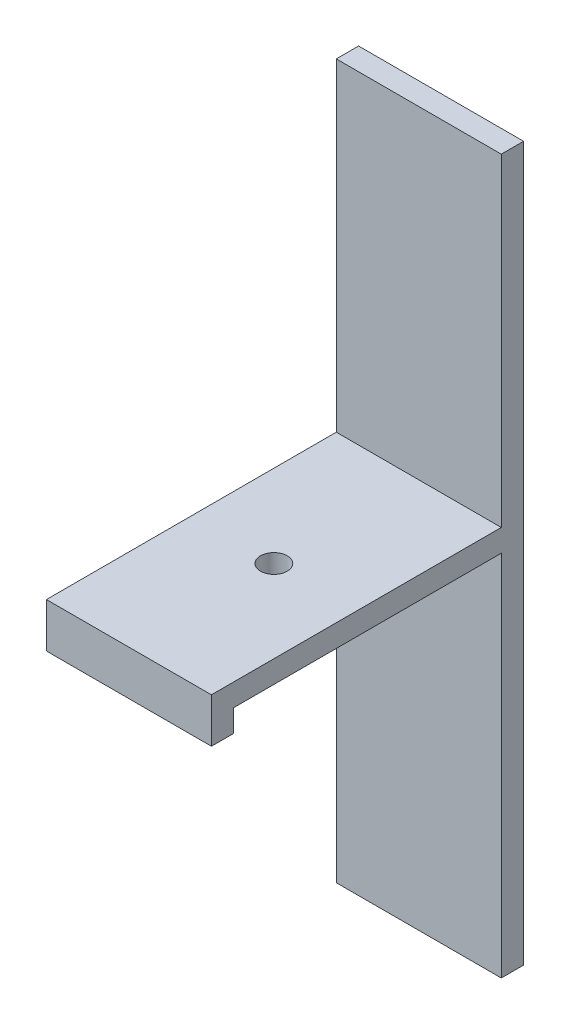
ISO-10303-21;
HEADER;
FILE_DESCRIPTION(('STEP AP214'),'2;1');
FILE_NAME('part.step','',(''),(''),'','','');
FILE_SCHEMA(('AUTOMOTIVE_DESIGN { 1 0 10303 214 1 1 1 1 }'));
ENDSEC;
DATA;
#1=APPLICATION_CONTEXT('core data for automotive mechanical design processes');
#2=APPLICATION_PROTOCOL_DEFINITION('international standard','automotive_design',2000,#1);
#3=PRODUCT_CONTEXT('',#1,'mechanical');
#4=PRODUCT('Part','Part','',(#3));
#5=PRODUCT_RELATED_PRODUCT_CATEGORY('part','',(#4));
#6=PRODUCT_DEFINITION_FORMATION('','',#4);
#7=PRODUCT_DEFINITION_CONTEXT('part definition',#1,'design');
#8=PRODUCT_DEFINITION('design','',#6,#7);
#9=PRODUCT_DEFINITION_SHAPE('','',#8);
#10=(LENGTH_UNIT() NAMED_UNIT(*) SI_UNIT(.MILLI.,.METRE.));
#11=(NAMED_UNIT(*) PLANE_ANGLE_UNIT() SI_UNIT($,.RADIAN.));
#12=(NAMED_UNIT(*) SI_UNIT($,.STERADIAN.) SOLID_ANGLE_UNIT());
#13=UNCERTAINTY_MEASURE_WITH_UNIT(LENGTH_MEASURE(1.E-05),#10,'distance_accuracy_value','');
#14=(GEOMETRIC_REPRESENTATION_CONTEXT(3) GLOBAL_UNCERTAINTY_ASSIGNED_CONTEXT((#13)) GLOBAL_UNIT_ASSIGNED_CONTEXT((#10,
#11,#12)) REPRESENTATION_CONTEXT('',''));
#15=CARTESIAN_POINT('',(0.,0.,0.));
#16=DIRECTION('',(0.,0.,1.));
#17=DIRECTION('',(1.,0.,0.));
#18=AXIS2_PLACEMENT_3D('',#15,#16,#17);
#19=CARTESIAN_POINT('',(-37.,-2.5,70.));
#20=DIRECTION('',(0.,1.,0.));
#21=DIRECTION('',(0.,0.,1.));
#22=AXIS2_PLACEMENT_3D('',#19,#20,#21);
#23=PLANE('',#22);
#24=CARTESIAN_POINT('',(-18.5,-2.5,37.5));
#25=DIRECTION('',(0.,1.,0.));
#26=DIRECTION('',(0.,0.,1.));
#27=AXIS2_PLACEMENT_3D('',#24,#25,#26);
#28=CIRCLE('',#27,3.);
#29=CARTESIAN_POINT('',(-18.5,-2.5,40.5));
#30=VERTEX_POINT('',#29);
#31=EDGE_CURVE('E138',#30,#30,#28,.T.);
#32=ORIENTED_EDGE('',*,*,#31,.T.);
#33=EDGE_LOOP('',(#32));
#34=FACE_BOUND('',#33,.T.);
#35=DIRECTION('',(1.,0.,0.));
#36=VECTOR('',#35,1.);
#37=CARTESIAN_POINT('',(-37.,-2.5,65.));
#38=LINE('',#37,#36);
#39=CARTESIAN_POINT('',(-37.,-2.5,65.));
#40=VERTEX_POINT('',#39);
#41=CARTESIAN_POINT('',(0.,-2.5,65.));
#42=VERTEX_POINT('',#41);
#43=EDGE_CURVE('E131',#40,#42,#38,.T.);
#44=ORIENTED_EDGE('',*,*,#43,.F.);
#45=DIRECTION('',(0.,0.,-1.));
#46=VECTOR('',#45,1.);
#47=CARTESIAN_POINT('',(-37.,-2.5,70.));
#48=LINE('',#47,#46);
#49=CARTESIAN_POINT('',(-37.,-2.5,5.));
#50=VERTEX_POINT('',#49);
#51=EDGE_CURVE('E48',#40,#50,#48,.T.);
#52=ORIENTED_EDGE('',*,*,#51,.T.);
#53=DIRECTION('',(1.,0.,0.));
#54=VECTOR('',#53,1.);
#55=CARTESIAN_POINT('',(-37.,-2.5,5.));
#56=LINE('',#55,#54);
#57=CARTESIAN_POINT('',(0.,-2.5,5.));
#58=VERTEX_POINT('',#57);
#59=EDGE_CURVE('E145',#50,#58,#56,.T.);
#60=ORIENTED_EDGE('',*,*,#59,.T.);
#61=DIRECTION('',(0.,0.,-1.));
#62=VECTOR('',#61,1.);
#63=CARTESIAN_POINT('',(0.,-2.5,70.));
#64=LINE('',#63,#62);
#65=EDGE_CURVE('E161',#42,#58,#64,.T.);
#66=ORIENTED_EDGE('',*,*,#65,.F.);
#67=EDGE_LOOP('',(#44,#52,#60,#66));
#68=FACE_BOUND('',#67,.T.);
#69=ADVANCED_FACE('F33',(#34,#68),#23,.F.);
#70=CARTESIAN_POINT('',(0.,0.,5.));
#71=DIRECTION('',(0.,0.,1.));
#72=DIRECTION('',(1.,0.,0.));
#73=AXIS2_PLACEMENT_3D('',#70,#71,#72);
#74=PLANE('',#73);
#75=DIRECTION('',(0.,-1.,0.));
#76=VECTOR('',#75,1.);
#77=CARTESIAN_POINT('',(-37.,75.,5.));
#78=LINE('',#77,#76);
#79=CARTESIAN_POINT('',(-37.,75.,5.));
#80=VERTEX_POINT('',#79);
#81=CARTESIAN_POINT('',(-37.,2.5,5.));
#82=VERTEX_POINT('',#81);
#83=EDGE_CURVE('E56',#80,#82,#78,.T.);
#84=ORIENTED_EDGE('',*,*,#83,.T.);
#85=DIRECTION('',(1.,0.,0.));
#86=VECTOR('',#85,1.);
#87=CARTESIAN_POINT('',(-37.,2.5,5.));
#88=LINE('',#87,#86);
#89=CARTESIAN_POINT('',(0.,2.5,5.));
#90=VERTEX_POINT('',#89);
#91=EDGE_CURVE('E149',#82,#90,#88,.T.);
#92=ORIENTED_EDGE('',*,*,#91,.T.);
#93=DIRECTION('',(0.,1.,0.));
#94=VECTOR('',#93,1.);
#95=CARTESIAN_POINT('',(0.,75.,5.));
#96=LINE('',#95,#94);
#97=CARTESIAN_POINT('',(0.,75.,5.));
#98=VERTEX_POINT('',#97);
#99=EDGE_CURVE('E169',#90,#98,#96,.T.);
#100=ORIENTED_EDGE('',*,*,#99,.T.);
#101=DIRECTION('',(-1.,0.,0.));
#102=VECTOR('',#101,1.);
#103=CARTESIAN_POINT('',(-37.,75.,5.));
#104=LINE('',#103,#102);
#105=EDGE_CURVE('E168',#98,#80,#104,.T.);
#106=ORIENTED_EDGE('',*,*,#105,.T.);
#107=EDGE_LOOP('',(#84,#92,#100,#106));
#108=FACE_BOUND('',#107,.T.);
#109=ADVANCED_FACE('F218',(#108),#74,.T.);
#110=CARTESIAN_POINT('',(0.,75.,5.));
#111=DIRECTION('',(-1.,0.,0.));
#112=DIRECTION('',(0.,-1.,0.));
#113=AXIS2_PLACEMENT_3D('',#110,#111,#112);
#114=PLANE('',#113);
#115=DIRECTION('',(0.,1.,0.));
#116=VECTOR('',#115,1.);
#117=CARTESIAN_POINT('',(0.,75.,0.));
#118=LINE('',#117,#116);
#119=CARTESIAN_POINT('',(0.,-85.,0.));
#120=VERTEX_POINT('',#119);
#121=CARTESIAN_POINT('',(0.,75.,0.));
#122=VERTEX_POINT('',#121);
#123=EDGE_CURVE('E164',#120,#122,#118,.T.);
#124=ORIENTED_EDGE('',*,*,#123,.T.);
#125=DIRECTION('',(0.,0.,-1.));
#126=VECTOR('',#125,1.);
#127=CARTESIAN_POINT('',(0.,75.,5.));
#128=LINE('',#127,#126);
#129=EDGE_CURVE('E11',#98,#122,#128,.T.);
#130=ORIENTED_EDGE('',*,*,#129,.F.);
#131=ORIENTED_EDGE('',*,*,#99,.F.);
#132=DIRECTION('',(0.,0.,-1.));
#133=VECTOR('',#132,1.);
#134=CARTESIAN_POINT('',(0.,2.5,70.));
#135=LINE('',#134,#133);
#136=CARTESIAN_POINT('',(0.,2.5,70.));
#137=VERTEX_POINT('',#136);
#138=EDGE_CURVE('E158',#137,#90,#135,.T.);
#139=ORIENTED_EDGE('',*,*,#138,.F.);
#140=DIRECTION('',(0.,-1.,0.));
#141=VECTOR('',#140,1.);
#142=CARTESIAN_POINT('',(0.,2.5,70.));
#143=LINE('',#142,#141);
#144=CARTESIAN_POINT('',(0.,-7.5,70.));
#145=VERTEX_POINT('',#144);
#146=EDGE_CURVE('E148',#137,#145,#143,.T.);
#147=ORIENTED_EDGE('',*,*,#146,.T.);
#148=DIRECTION('',(0.,0.,1.));
#149=VECTOR('',#148,1.);
#150=CARTESIAN_POINT('',(0.,-7.5,70.));
#151=LINE('',#150,#149);
#152=CARTESIAN_POINT('',(0.,-7.5,65.));
#153=VERTEX_POINT('',#152);
#154=EDGE_CURVE('E121',#153,#145,#151,.T.);
#155=ORIENTED_EDGE('',*,*,#154,.F.);
#156=DIRECTION('',(0.,1.,0.));
#157=VECTOR('',#156,1.);
#158=CARTESIAN_POINT('',(0.,-7.5,65.));
#159=LINE('',#158,#157);
#160=EDGE_CURVE('E117',#153,#42,#159,.T.);
#161=ORIENTED_EDGE('',*,*,#160,.T.);
#162=ORIENTED_EDGE('',*,*,#65,.T.);
#163=CARTESIAN_POINT('',(0.,-85.,5.));
#164=VERTEX_POINT('',#163);
#165=EDGE_CURVE('E165',#164,#58,#96,.T.);
#166=ORIENTED_EDGE('',*,*,#165,.F.);
#167=DIRECTION('',(0.,0.,-1.));
#168=VECTOR('',#167,1.);
#169=CARTESIAN_POINT('',(0.,-85.,5.));
#170=LINE('',#169,#168);
#171=EDGE_CURVE('E175',#164,#120,#170,.T.);
#172=ORIENTED_EDGE('',*,*,#171,.T.);
#173=EDGE_LOOP('',(#124,#130,#131,#139,#147,#155,#161,#162,#166,#172));
#174=FACE_BOUND('',#173,.T.);
#175=ADVANCED_FACE('F35',(#174),#114,.F.);
#176=CARTESIAN_POINT('',(-37.,75.,5.));
#177=DIRECTION('',(0.,-1.,0.));
#178=DIRECTION('',(0.,0.,-1.));
#179=AXIS2_PLACEMENT_3D('',#176,#177,#178);
#180=PLANE('',#179);
#181=DIRECTION('',(-1.,0.,0.));
#182=VECTOR('',#181,1.);
#183=CARTESIAN_POINT('',(-37.,75.,0.));
#184=LINE('',#183,#182);
#185=CARTESIAN_POINT('',(-37.,75.,0.));
#186=VERTEX_POINT('',#185);
#187=EDGE_CURVE('E178',#122,#186,#184,.T.);
#188=ORIENTED_EDGE('',*,*,#187,.T.);
#189=DIRECTION('',(0.,0.,-1.));
#190=VECTOR('',#189,1.);
#191=CARTESIAN_POINT('',(-37.,75.,5.));
#192=LINE('',#191,#190);
#193=EDGE_CURVE('E41',#80,#186,#192,.T.);
#194=ORIENTED_EDGE('',*,*,#193,.F.);
#195=ORIENTED_EDGE('',*,*,#105,.F.);
#196=ORIENTED_EDGE('',*,*,#129,.T.);
#197=EDGE_LOOP('',(#188,#194,#195,#196));
#198=FACE_BOUND('',#197,.T.);
#199=ADVANCED_FACE('F219',(#198),#180,.F.);
#200=CARTESIAN_POINT('',(-37.,75.,5.));
#201=DIRECTION('',(1.,0.,0.));
#202=DIRECTION('',(0.,1.,0.));
#203=AXIS2_PLACEMENT_3D('',#200,#201,#202);
#204=PLANE('',#203);
#205=DIRECTION('',(0.,-1.,0.));
#206=VECTOR('',#205,1.);
#207=CARTESIAN_POINT('',(-37.,75.,0.));
#208=LINE('',#207,#206);
#209=CARTESIAN_POINT('',(-37.,-85.,0.));
#210=VERTEX_POINT('',#209);
#211=EDGE_CURVE('E180',#186,#210,#208,.T.);
#212=ORIENTED_EDGE('',*,*,#211,.T.);
#213=DIRECTION('',(0.,0.,-1.));
#214=VECTOR('',#213,1.);
#215=CARTESIAN_POINT('',(-37.,-85.,5.));
#216=LINE('',#215,#214);
#217=CARTESIAN_POINT('',(-37.,-85.,5.));
#218=VERTEX_POINT('',#217);
#219=EDGE_CURVE('E186',#218,#210,#216,.T.);
#220=ORIENTED_EDGE('',*,*,#219,.F.);
#221=EDGE_CURVE('E171',#50,#218,#78,.T.);
#222=ORIENTED_EDGE('',*,*,#221,.F.);
#223=ORIENTED_EDGE('',*,*,#51,.F.);
#224=DIRECTION('',(0.,1.,0.));
#225=VECTOR('',#224,1.);
#226=CARTESIAN_POINT('',(-37.,-7.5,65.));
#227=LINE('',#226,#225);
#228=CARTESIAN_POINT('',(-37.,-7.5,65.));
#229=VERTEX_POINT('',#228);
#230=EDGE_CURVE('E115',#229,#40,#227,.T.);
#231=ORIENTED_EDGE('',*,*,#230,.F.);
#232=DIRECTION('',(0.,0.,-1.));
#233=VECTOR('',#232,1.);
#234=CARTESIAN_POINT('',(-37.,-7.5,70.));
#235=LINE('',#234,#233);
#236=CARTESIAN_POINT('',(-37.,-7.5,70.));
#237=VERTEX_POINT('',#236);
#238=EDGE_CURVE('E122',#237,#229,#235,.T.);
#239=ORIENTED_EDGE('',*,*,#238,.F.);
#240=DIRECTION('',(0.,-1.,0.));
#241=VECTOR('',#240,1.);
#242=CARTESIAN_POINT('',(-37.,2.5,70.));
#243=LINE('',#242,#241);
#244=CARTESIAN_POINT('',(-37.,2.5,70.));
#245=VERTEX_POINT('',#244);
#246=EDGE_CURVE('E146',#245,#237,#243,.T.);
#247=ORIENTED_EDGE('',*,*,#246,.F.);
#248=DIRECTION('',(0.,0.,-1.));
#249=VECTOR('',#248,1.);
#250=CARTESIAN_POINT('',(-37.,2.5,70.));
#251=LINE('',#250,#249);
#252=EDGE_CURVE('E154',#245,#82,#251,.T.);
#253=ORIENTED_EDGE('',*,*,#252,.T.);
#254=ORIENTED_EDGE('',*,*,#83,.F.);
#255=ORIENTED_EDGE('',*,*,#193,.T.);
#256=EDGE_LOOP('',(#212,#220,#222,#223,#231,#239,#247,#253,#254,#255));
#257=FACE_BOUND('',#256,.T.);
#258=ADVANCED_FACE('F133',(#257),#204,.F.);
#259=CARTESIAN_POINT('',(-37.,-85.,5.));
#260=DIRECTION('',(0.,1.,0.));
#261=DIRECTION('',(0.,0.,1.));
#262=AXIS2_PLACEMENT_3D('',#259,#260,#261);
#263=PLANE('',#262);
#264=DIRECTION('',(1.,0.,0.));
#265=VECTOR('',#264,1.);
#266=CARTESIAN_POINT('',(-37.,-85.,0.));
#267=LINE('',#266,#265);
#268=EDGE_CURVE('E182',#210,#120,#267,.T.);
#269=ORIENTED_EDGE('',*,*,#268,.T.);
#270=ORIENTED_EDGE('',*,*,#171,.F.);
#271=DIRECTION('',(1.,0.,0.));
#272=VECTOR('',#271,1.);
#273=CARTESIAN_POINT('',(-37.,-85.,5.));
#274=LINE('',#273,#272);
#275=EDGE_CURVE('E173',#218,#164,#274,.T.);
#276=ORIENTED_EDGE('',*,*,#275,.F.);
#277=ORIENTED_EDGE('',*,*,#219,.T.);
#278=EDGE_LOOP('',(#269,#270,#276,#277));
#279=FACE_BOUND('',#278,.T.);
#280=ADVANCED_FACE('F200',(#279),#263,.F.);
#281=ORIENTED_EDGE('',*,*,#59,.F.);
#282=ORIENTED_EDGE('',*,*,#221,.T.);
#283=ORIENTED_EDGE('',*,*,#275,.T.);
#284=ORIENTED_EDGE('',*,*,#165,.T.);
#285=EDGE_LOOP('',(#281,#282,#283,#284));
#286=FACE_BOUND('',#285,.T.);
#287=ADVANCED_FACE('F207',(#286),#74,.T.);
#288=CARTESIAN_POINT('',(0.,0.,0.));
#289=DIRECTION('',(0.,0.,1.));
#290=DIRECTION('',(1.,0.,0.));
#291=AXIS2_PLACEMENT_3D('',#288,#289,#290);
#292=PLANE('',#291);
#293=ORIENTED_EDGE('',*,*,#123,.F.);
#294=ORIENTED_EDGE('',*,*,#268,.F.);
#295=ORIENTED_EDGE('',*,*,#211,.F.);
#296=ORIENTED_EDGE('',*,*,#187,.F.);
#297=EDGE_LOOP('',(#293,#294,#295,#296));
#298=FACE_BOUND('',#297,.T.);
#299=ADVANCED_FACE('F197',(#298),#292,.F.);
#300=CARTESIAN_POINT('',(-37.,2.5,70.));
#301=DIRECTION('',(0.,1.,0.));
#302=DIRECTION('',(0.,0.,1.));
#303=AXIS2_PLACEMENT_3D('',#300,#301,#302);
#304=PLANE('',#303);
#305=CARTESIAN_POINT('',(-18.5,2.5,37.5));
#306=DIRECTION('',(0.,1.,0.));
#307=DIRECTION('',(0.,0.,1.));
#308=AXIS2_PLACEMENT_3D('',#305,#306,#307);
#309=CIRCLE('',#308,3.);
#310=CARTESIAN_POINT('',(-18.5,2.5,40.5));
#311=VERTEX_POINT('',#310);
#312=EDGE_CURVE('E135',#311,#311,#309,.T.);
#313=ORIENTED_EDGE('',*,*,#312,.F.);
#314=EDGE_LOOP('',(#313));
#315=FACE_BOUND('',#314,.T.);
#316=ORIENTED_EDGE('',*,*,#91,.F.);
#317=ORIENTED_EDGE('',*,*,#252,.F.);
#318=DIRECTION('',(1.,0.,0.));
#319=VECTOR('',#318,1.);
#320=CARTESIAN_POINT('',(-37.,2.5,70.));
#321=LINE('',#320,#319);
#322=EDGE_CURVE('E151',#245,#137,#321,.T.);
#323=ORIENTED_EDGE('',*,*,#322,.T.);
#324=ORIENTED_EDGE('',*,*,#138,.T.);
#325=EDGE_LOOP('',(#316,#317,#323,#324));
#326=FACE_BOUND('',#325,.T.);
#327=ADVANCED_FACE('F216',(#315,#326),#304,.T.);
#328=CARTESIAN_POINT('',(0.,0.,70.));
#329=DIRECTION('',(0.,0.,1.));
#330=DIRECTION('',(1.,0.,0.));
#331=AXIS2_PLACEMENT_3D('',#328,#329,#330);
#332=PLANE('',#331);
#333=ORIENTED_EDGE('',*,*,#246,.T.);
#334=DIRECTION('',(-1.,0.,0.));
#335=VECTOR('',#334,1.);
#336=CARTESIAN_POINT('',(-37.,-7.5,70.));
#337=LINE('',#336,#335);
#338=EDGE_CURVE('E128',#145,#237,#337,.T.);
#339=ORIENTED_EDGE('',*,*,#338,.F.);
#340=ORIENTED_EDGE('',*,*,#146,.F.);
#341=ORIENTED_EDGE('',*,*,#322,.F.);
#342=EDGE_LOOP('',(#333,#339,#340,#341));
#343=FACE_BOUND('',#342,.T.);
#344=ADVANCED_FACE('F212',(#343),#332,.T.);
#345=CARTESIAN_POINT('',(-18.5,-27.5,37.5));
#346=DIRECTION('',(0.,1.,0.));
#347=DIRECTION('',(0.,0.,1.));
#348=AXIS2_PLACEMENT_3D('',#345,#346,#347);
#349=CYLINDRICAL_SURFACE('',#348,3.);
#350=ORIENTED_EDGE('',*,*,#312,.T.);
#351=EDGE_LOOP('',(#350));
#352=FACE_BOUND('',#351,.T.);
#353=ORIENTED_EDGE('',*,*,#31,.F.);
#354=EDGE_LOOP('',(#353));
#355=FACE_BOUND('',#354,.T.);
#356=ADVANCED_FACE('F266',(#352,#355),#349,.F.);
#357=CARTESIAN_POINT('',(-37.,-7.5,65.));
#358=DIRECTION('',(0.,0.,1.));
#359=DIRECTION('',(1.,0.,0.));
#360=AXIS2_PLACEMENT_3D('',#357,#358,#359);
#361=PLANE('',#360);
#362=ORIENTED_EDGE('',*,*,#43,.T.);
#363=ORIENTED_EDGE('',*,*,#160,.F.);
#364=DIRECTION('',(1.,0.,0.));
#365=VECTOR('',#364,1.);
#366=CARTESIAN_POINT('',(-37.,-7.5,65.));
#367=LINE('',#366,#365);
#368=EDGE_CURVE('E111',#229,#153,#367,.T.);
#369=ORIENTED_EDGE('',*,*,#368,.F.);
#370=ORIENTED_EDGE('',*,*,#230,.T.);
#371=EDGE_LOOP('',(#362,#363,#369,#370));
#372=FACE_BOUND('',#371,.T.);
#373=ADVANCED_FACE('F113',(#372),#361,.F.);
#374=CARTESIAN_POINT('',(0.,-7.5,0.));
#375=DIRECTION('',(0.,-1.,0.));
#376=DIRECTION('',(0.,0.,-1.));
#377=AXIS2_PLACEMENT_3D('',#374,#375,#376);
#378=PLANE('',#377);
#379=ORIENTED_EDGE('',*,*,#238,.T.);
#380=ORIENTED_EDGE('',*,*,#368,.T.);
#381=ORIENTED_EDGE('',*,*,#154,.T.);
#382=ORIENTED_EDGE('',*,*,#338,.T.);
#383=EDGE_LOOP('',(#379,#380,#381,#382));
#384=FACE_BOUND('',#383,.T.);
#385=ADVANCED_FACE('F126',(#384),#378,.T.);
#386=CLOSED_SHELL('',(#69,#109,#175,#199,#258,#280,#287,#299,#327,#344,#356,#373,#385));
#387=MANIFOLD_SOLID_BREP('B2',#386);
#388=ADVANCED_BREP_SHAPE_REPRESENTATION('',(#18,#387),#14);
#389=SHAPE_DEFINITION_REPRESENTATION(#9,#388);
ENDSEC;
END-ISO-10303-21;
